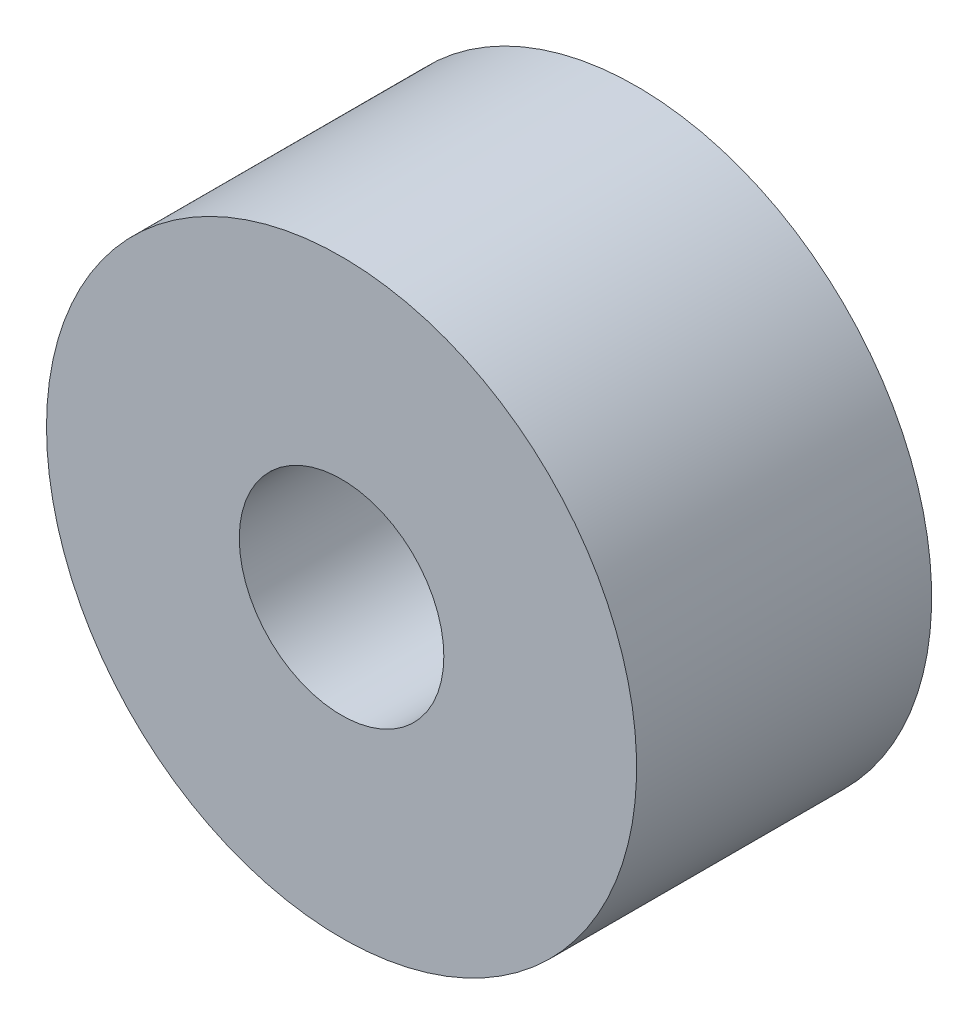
from build123d import *

# Parameters (mm, degrees)
SKETCH1_R          = 9.525
SKETCH1_R_2        = 3.302
BASE_EXTRUDE_DEPTH = 9.525


with BuildPart() as part:
    # Sketch1 → Base-Extrude (new body)
    with BuildSketch(Plane.XY):
        with Locations(Location((0, 0, 0), (0, 0, 180))):
            Circle(SKETCH1_R)
        with Locations(Location((0, 0, 0), (0, 0, 180))):
            Circle(SKETCH1_R_2, mode=Mode.SUBTRACT)
    extrude(amount=BASE_EXTRUDE_DEPTH)


solid = part.part
